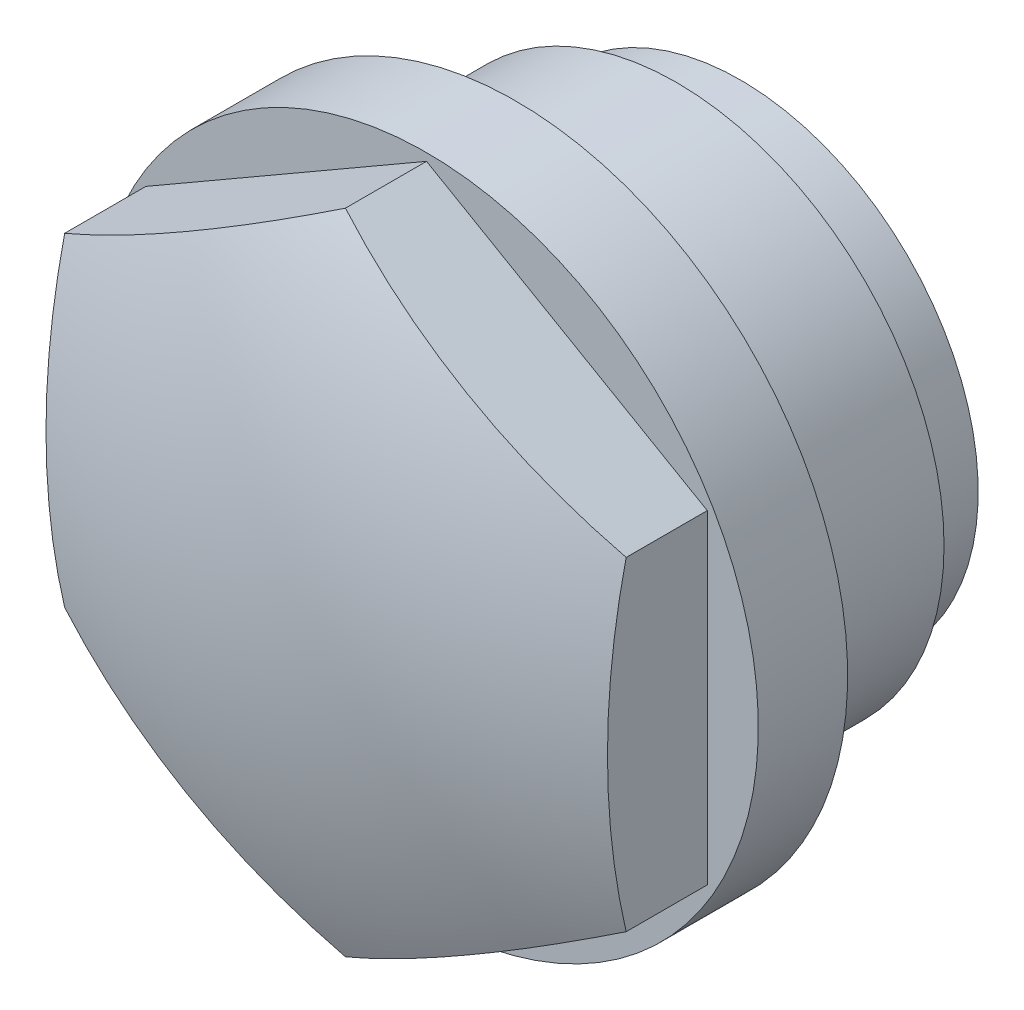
ISO-10303-21;
HEADER;
FILE_DESCRIPTION(('STEP AP214'),'2;1');
FILE_NAME('part.step','',(''),(''),'','','');
FILE_SCHEMA(('AUTOMOTIVE_DESIGN { 1 0 10303 214 1 1 1 1 }'));
ENDSEC;
DATA;
#1=APPLICATION_CONTEXT('core data for automotive mechanical design processes');
#2=APPLICATION_PROTOCOL_DEFINITION('international standard','automotive_design',2000,#1);
#3=PRODUCT_CONTEXT('',#1,'mechanical');
#4=PRODUCT('Part','Part','',(#3));
#5=PRODUCT_RELATED_PRODUCT_CATEGORY('part','',(#4));
#6=PRODUCT_DEFINITION_FORMATION('','',#4);
#7=PRODUCT_DEFINITION_CONTEXT('part definition',#1,'design');
#8=PRODUCT_DEFINITION('design','',#6,#7);
#9=PRODUCT_DEFINITION_SHAPE('','',#8);
#10=(LENGTH_UNIT() NAMED_UNIT(*) SI_UNIT(.MILLI.,.METRE.));
#11=(NAMED_UNIT(*) PLANE_ANGLE_UNIT() SI_UNIT($,.RADIAN.));
#12=(NAMED_UNIT(*) SI_UNIT($,.STERADIAN.) SOLID_ANGLE_UNIT());
#13=UNCERTAINTY_MEASURE_WITH_UNIT(LENGTH_MEASURE(1.E-05),#10,'distance_accuracy_value','');
#14=(GEOMETRIC_REPRESENTATION_CONTEXT(3) GLOBAL_UNCERTAINTY_ASSIGNED_CONTEXT((#13)) GLOBAL_UNIT_ASSIGNED_CONTEXT((#10,
#11,#12)) REPRESENTATION_CONTEXT('',''));
#15=CARTESIAN_POINT('',(0.,0.,0.));
#16=DIRECTION('',(0.,0.,1.));
#17=DIRECTION('',(1.,0.,0.));
#18=AXIS2_PLACEMENT_3D('',#15,#16,#17);
#19=CARTESIAN_POINT('',(0.,0.,-14.638539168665));
#20=DIRECTION('',(0.,0.,-1.));
#21=DIRECTION('',(-1.,0.,0.));
#22=AXIS2_PLACEMENT_3D('',#19,#20,#21);
#23=CYLINDRICAL_SURFACE('',#22,13.);
#24=CARTESIAN_POINT('',(0.,0.,0.));
#25=DIRECTION('',(0.,0.,-1.));
#26=DIRECTION('',(-1.,0.,0.));
#27=AXIS2_PLACEMENT_3D('',#24,#25,#26);
#28=CIRCLE('',#27,13.);
#29=CARTESIAN_POINT('',(-13.,0.,0.));
#30=VERTEX_POINT('',#29);
#31=EDGE_CURVE('E103',#30,#30,#28,.T.);
#32=ORIENTED_EDGE('',*,*,#31,.F.);
#33=EDGE_LOOP('',(#32));
#34=FACE_BOUND('',#33,.T.);
#35=CARTESIAN_POINT('',(0.,0.,3.5));
#36=DIRECTION('',(0.,0.,-1.));
#37=DIRECTION('',(-1.,0.,0.));
#38=AXIS2_PLACEMENT_3D('',#35,#36,#37);
#39=CIRCLE('',#38,13.);
#40=CARTESIAN_POINT('',(-13.,0.,3.5));
#41=VERTEX_POINT('',#40);
#42=EDGE_CURVE('E118',#41,#41,#39,.T.);
#43=ORIENTED_EDGE('',*,*,#42,.T.);
#44=EDGE_LOOP('',(#43));
#45=FACE_BOUND('',#44,.T.);
#46=ADVANCED_FACE('F14',(#34,#45),#23,.T.);
#47=CARTESIAN_POINT('',(0.,12.7017059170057,3.5));
#48=DIRECTION('',(0.,0.,-1.));
#49=DIRECTION('',(-1.,0.,0.));
#50=AXIS2_PLACEMENT_3D('',#47,#48,#49);
#51=PLANE('',#50);
#52=ORIENTED_EDGE('',*,*,#42,.F.);
#53=EDGE_LOOP('',(#52));
#54=FACE_BOUND('',#53,.T.);
#55=DIRECTION('',(0.,1.,0.));
#56=VECTOR('',#55,1.);
#57=CARTESIAN_POINT('',(-10.9999999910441,-6.35085295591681,3.5));
#58=LINE('',#57,#56);
#59=CARTESIAN_POINT('',(-10.9999999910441,-6.35085295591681,3.5));
#60=VERTEX_POINT('',#59);
#61=CARTESIAN_POINT('',(-10.9999999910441,6.3508529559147,3.5));
#62=VERTEX_POINT('',#61);
#63=EDGE_CURVE('E93',#60,#62,#58,.T.);
#64=ORIENTED_EDGE('',*,*,#63,.T.);
#65=DIRECTION('',(0.866025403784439,0.5,0.));
#66=VECTOR('',#65,1.);
#67=CARTESIAN_POINT('',(-10.9999999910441,6.3508529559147,3.5));
#68=LINE('',#67,#66);
#69=CARTESIAN_POINT('',(-7.35522753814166E-13,12.7017059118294,3.5));
#70=VERTEX_POINT('',#69);
#71=EDGE_CURVE('E83',#62,#70,#68,.T.);
#72=ORIENTED_EDGE('',*,*,#71,.T.);
#73=DIRECTION('',(0.866025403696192,-0.500000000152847,0.));
#74=VECTOR('',#73,1.);
#75=CARTESIAN_POINT('',(-7.35522753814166E-13,12.7017059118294,3.5));
#76=LINE('',#75,#74);
#77=CARTESIAN_POINT('',(10.99999999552,6.3508529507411,3.5));
#78=VERTEX_POINT('',#77);
#79=EDGE_CURVE('E68',#70,#78,#76,.T.);
#80=ORIENTED_EDGE('',*,*,#79,.T.);
#81=DIRECTION('',(0.,-1.,0.));
#82=VECTOR('',#81,1.);
#83=CARTESIAN_POINT('',(10.99999999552,6.3508529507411,3.5));
#84=LINE('',#83,#82);
#85=CARTESIAN_POINT('',(10.99999999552,-6.3508529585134,3.5));
#86=VERTEX_POINT('',#85);
#87=EDGE_CURVE('E80',#78,#86,#84,.T.);
#88=ORIENTED_EDGE('',*,*,#87,.T.);
#89=DIRECTION('',(-0.86602540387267,-0.499999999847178,0.));
#90=VECTOR('',#89,1.);
#91=CARTESIAN_POINT('',(10.99999999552,-6.35085295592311,3.5));
#92=LINE('',#91,#90);
#93=CARTESIAN_POINT('',(1.97758476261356E-12,-12.7017059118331,3.5));
#94=VERTEX_POINT('',#93);
#95=EDGE_CURVE('E28',#86,#94,#92,.T.);
#96=ORIENTED_EDGE('',*,*,#95,.T.);
#97=DIRECTION('',(-0.866025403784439,0.5,0.));
#98=VECTOR('',#97,1.);
#99=CARTESIAN_POINT('',(1.97758476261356E-12,-12.7017059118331,3.5));
#100=LINE('',#99,#98);
#101=EDGE_CURVE('E87',#94,#60,#100,.T.);
#102=ORIENTED_EDGE('',*,*,#101,.T.);
#103=EDGE_LOOP('',(#64,#72,#80,#88,#96,#102));
#104=FACE_BOUND('',#103,.T.);
#105=ADVANCED_FACE('F79',(#54,#104),#51,.F.);
#106=CARTESIAN_POINT('',(0.,0.,-8.8));
#107=DIRECTION('',(0.,0.,-1.));
#108=DIRECTION('',(-1.,0.,0.));
#109=AXIS2_PLACEMENT_3D('',#106,#107,#108);
#110=PLANE('',#109);
#111=CARTESIAN_POINT('',(0.,0.,-8.8));
#112=DIRECTION('',(0.,0.,-1.));
#113=DIRECTION('',(-1.,0.,0.));
#114=AXIS2_PLACEMENT_3D('',#111,#112,#113);
#115=CIRCLE('',#114,9.3155);
#116=CARTESIAN_POINT('',(-9.3155,0.,-8.8));
#117=VERTEX_POINT('',#116);
#118=EDGE_CURVE('E115',#117,#117,#115,.T.);
#119=ORIENTED_EDGE('',*,*,#118,.T.);
#120=EDGE_LOOP('',(#119));
#121=FACE_BOUND('',#120,.T.);
#122=ADVANCED_FACE('F160',(#121),#110,.T.);
#123=CARTESIAN_POINT('',(0.,0.,-14.638539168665));
#124=DIRECTION('',(0.,0.,-1.));
#125=DIRECTION('',(-1.,0.,0.));
#126=AXIS2_PLACEMENT_3D('',#123,#124,#125);
#127=CYLINDRICAL_SURFACE('',#126,9.3155);
#128=ORIENTED_EDGE('',*,*,#118,.F.);
#129=EDGE_LOOP('',(#128));
#130=FACE_BOUND('',#129,.T.);
#131=CARTESIAN_POINT('',(0.,0.,-6.3));
#132=DIRECTION('',(0.,0.,-1.));
#133=DIRECTION('',(-1.,0.,0.));
#134=AXIS2_PLACEMENT_3D('',#131,#132,#133);
#135=CIRCLE('',#134,9.3155);
#136=CARTESIAN_POINT('',(-9.3155,0.,-6.3));
#137=VERTEX_POINT('',#136);
#138=EDGE_CURVE('E112',#137,#137,#135,.T.);
#139=ORIENTED_EDGE('',*,*,#138,.T.);
#140=EDGE_LOOP('',(#139));
#141=FACE_BOUND('',#140,.T.);
#142=ADVANCED_FACE('F184',(#130,#141),#127,.T.);
#143=CARTESIAN_POINT('',(0.,9.3155,-6.3));
#144=DIRECTION('',(0.,0.,-1.));
#145=DIRECTION('',(-1.,0.,0.));
#146=AXIS2_PLACEMENT_3D('',#143,#144,#145);
#147=PLANE('',#146);
#148=CARTESIAN_POINT('',(0.,0.,-6.3));
#149=DIRECTION('',(0.,0.,-1.));
#150=DIRECTION('',(-1.,0.,0.));
#151=AXIS2_PLACEMENT_3D('',#148,#149,#150);
#152=CIRCLE('',#151,10.4775);
#153=CARTESIAN_POINT('',(-10.4775,0.,-6.3));
#154=VERTEX_POINT('',#153);
#155=EDGE_CURVE('E109',#154,#154,#152,.T.);
#156=ORIENTED_EDGE('',*,*,#155,.T.);
#157=EDGE_LOOP('',(#156));
#158=FACE_BOUND('',#157,.T.);
#159=ORIENTED_EDGE('',*,*,#138,.F.);
#160=EDGE_LOOP('',(#159));
#161=FACE_BOUND('',#160,.T.);
#162=ADVANCED_FACE('F177',(#158,#161),#147,.T.);
#163=CARTESIAN_POINT('',(0.,0.,-14.638539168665));
#164=DIRECTION('',(0.,0.,-1.));
#165=DIRECTION('',(-1.,0.,0.));
#166=AXIS2_PLACEMENT_3D('',#163,#164,#165);
#167=CYLINDRICAL_SURFACE('',#166,10.4775);
#168=ORIENTED_EDGE('',*,*,#155,.F.);
#169=EDGE_LOOP('',(#168));
#170=FACE_BOUND('',#169,.T.);
#171=CARTESIAN_POINT('',(0.,0.,0.));
#172=DIRECTION('',(0.,0.,-1.));
#173=DIRECTION('',(-1.,0.,0.));
#174=AXIS2_PLACEMENT_3D('',#171,#172,#173);
#175=CIRCLE('',#174,10.4775);
#176=CARTESIAN_POINT('',(-10.4775,0.,0.));
#177=VERTEX_POINT('',#176);
#178=EDGE_CURVE('E106',#177,#177,#175,.T.);
#179=ORIENTED_EDGE('',*,*,#178,.T.);
#180=EDGE_LOOP('',(#179));
#181=FACE_BOUND('',#180,.T.);
#182=ADVANCED_FACE('F168',(#170,#181),#167,.T.);
#183=CARTESIAN_POINT('',(0.,13.,0.));
#184=DIRECTION('',(0.,0.,1.));
#185=DIRECTION('',(1.,0.,0.));
#186=AXIS2_PLACEMENT_3D('',#183,#184,#185);
#187=PLANE('',#186);
#188=ORIENTED_EDGE('',*,*,#178,.F.);
#189=EDGE_LOOP('',(#188));
#190=FACE_BOUND('',#189,.T.);
#191=ORIENTED_EDGE('',*,*,#31,.T.);
#192=EDGE_LOOP('',(#191));
#193=FACE_BOUND('',#192,.T.);
#194=ADVANCED_FACE('F166',(#190,#193),#187,.F.);
#195=CARTESIAN_POINT('',(-10.9999999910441,6.3508529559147,9.50000000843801));
#196=DIRECTION('',(-0.5,0.866025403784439,0.));
#197=DIRECTION('',(0.866025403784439,0.5,0.));
#198=AXIS2_PLACEMENT_3D('',#195,#196,#197);
#199=PLANE('',#198);
#200=DIRECTION('',(0.,0.,-1.));
#201=VECTOR('',#200,1.);
#202=CARTESIAN_POINT('',(-7.35522753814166E-13,12.7017059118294,9.50000000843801));
#203=LINE('',#202,#201);
#204=CARTESIAN_POINT('',(-8.96633451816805E-09,12.7017059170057,6.67842281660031));
#205=VERTEX_POINT('',#204);
#206=EDGE_CURVE('E36',#205,#70,#203,.T.);
#207=ORIENTED_EDGE('',*,*,#206,.T.);
#208=ORIENTED_EDGE('',*,*,#71,.F.);
#209=DIRECTION('',(0.,0.,-1.));
#210=VECTOR('',#209,1.);
#211=CARTESIAN_POINT('',(-10.9999999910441,6.3508529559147,9.50000000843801));
#212=LINE('',#211,#210);
#213=CARTESIAN_POINT('',(-10.9999999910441,6.3508529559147,6.6784228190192));
#214=VERTEX_POINT('',#213);
#215=EDGE_CURVE('E101',#214,#62,#212,.T.);
#216=ORIENTED_EDGE('',*,*,#215,.F.);
#217=CARTESIAN_POINT('',(-5.49999999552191,9.52627943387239,-20.4999999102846));
#218=DIRECTION('',(-0.5,0.866025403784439,0.));
#219=DIRECTION('',(0.866025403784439,0.5,0.));
#220=AXIS2_PLACEMENT_3D('',#217,#218,#219);
#221=CIRCLE('',#220,27.9105713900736);
#222=EDGE_CURVE('E9',#205,#214,#221,.F.);
#223=ORIENTED_EDGE('',*,*,#222,.F.);
#224=EDGE_LOOP('',(#207,#208,#216,#223));
#225=FACE_BOUND('',#224,.T.);
#226=ADVANCED_FACE('F138',(#225),#199,.T.);
#227=CARTESIAN_POINT('',(-10.9999999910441,-6.35085295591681,9.50000000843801));
#228=DIRECTION('',(-1.,0.,0.));
#229=DIRECTION('',(0.,0.,1.));
#230=AXIS2_PLACEMENT_3D('',#227,#228,#229);
#231=PLANE('',#230);
#232=ORIENTED_EDGE('',*,*,#215,.T.);
#233=ORIENTED_EDGE('',*,*,#63,.F.);
#234=DIRECTION('',(0.,0.,-1.));
#235=VECTOR('',#234,1.);
#236=CARTESIAN_POINT('',(-10.9999999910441,-6.35085295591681,9.50000000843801));
#237=LINE('',#236,#235);
#238=CARTESIAN_POINT('',(-10.9999999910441,-6.35085295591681,6.6784228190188));
#239=VERTEX_POINT('',#238);
#240=EDGE_CURVE('E99',#239,#60,#237,.T.);
#241=ORIENTED_EDGE('',*,*,#240,.F.);
#242=CARTESIAN_POINT('',(-10.9999999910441,0.,-20.4999999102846));
#243=DIRECTION('',(-1.,0.,0.));
#244=DIRECTION('',(0.,0.,1.));
#245=AXIS2_PLACEMENT_3D('',#242,#243,#244);
#246=CIRCLE('',#245,27.9105713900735);
#247=EDGE_CURVE('E21',#214,#239,#246,.F.);
#248=ORIENTED_EDGE('',*,*,#247,.F.);
#249=EDGE_LOOP('',(#232,#233,#241,#248));
#250=FACE_BOUND('',#249,.T.);
#251=ADVANCED_FACE('F135',(#250),#231,.T.);
#252=CARTESIAN_POINT('',(1.97758476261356E-12,-12.7017059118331,9.50000000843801));
#253=DIRECTION('',(-0.5,-0.866025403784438,0.));
#254=DIRECTION('',(-0.866025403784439,0.5,0.));
#255=AXIS2_PLACEMENT_3D('',#252,#253,#254);
#256=PLANE('',#255);
#257=ORIENTED_EDGE('',*,*,#240,.T.);
#258=ORIENTED_EDGE('',*,*,#101,.F.);
#259=DIRECTION('',(0.,0.,-1.));
#260=VECTOR('',#259,1.);
#261=CARTESIAN_POINT('',(1.97758476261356E-12,-12.7017059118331,9.50000000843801));
#262=LINE('',#261,#260);
#263=CARTESIAN_POINT('',(1.98018684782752E-12,-12.7017059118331,6.6784228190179));
#264=VERTEX_POINT('',#263);
#265=EDGE_CURVE('E97',#264,#94,#262,.T.);
#266=ORIENTED_EDGE('',*,*,#265,.F.);
#267=CARTESIAN_POINT('',(-5.49999999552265,-9.526279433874,-20.4999999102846));
#268=DIRECTION('',(-0.5,-0.866025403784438,0.));
#269=DIRECTION('',(-0.866025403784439,0.5,0.));
#270=AXIS2_PLACEMENT_3D('',#267,#268,#269);
#271=CIRCLE('',#270,27.910571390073);
#272=EDGE_CURVE('E127',#239,#264,#271,.F.);
#273=ORIENTED_EDGE('',*,*,#272,.F.);
#274=EDGE_LOOP('',(#257,#258,#266,#273));
#275=FACE_BOUND('',#274,.T.);
#276=ADVANCED_FACE('F143',(#275),#256,.T.);
#277=CARTESIAN_POINT('',(10.99999999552,-6.35085295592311,9.50000000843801));
#278=DIRECTION('',(0.499999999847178,-0.86602540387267,0.));
#279=DIRECTION('',(-0.86602540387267,-0.499999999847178,0.));
#280=AXIS2_PLACEMENT_3D('',#277,#278,#279);
#281=PLANE('',#280);
#282=ORIENTED_EDGE('',*,*,#265,.T.);
#283=ORIENTED_EDGE('',*,*,#95,.F.);
#284=DIRECTION('',(0.,0.,-1.));
#285=VECTOR('',#284,1.);
#286=CARTESIAN_POINT('',(10.99999999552,-6.35085295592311,9.50000000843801));
#287=LINE('',#286,#285);
#288=CARTESIAN_POINT('',(10.99999999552,-6.35085295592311,6.67842281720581));
#289=VERTEX_POINT('',#288);
#290=EDGE_CURVE('E74',#289,#86,#287,.T.);
#291=ORIENTED_EDGE('',*,*,#290,.F.);
#292=CARTESIAN_POINT('',(5.49999999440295,-9.5262794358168,-20.4999999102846));
#293=DIRECTION('',(0.499999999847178,-0.86602540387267,0.));
#294=DIRECTION('',(-0.86602540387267,-0.499999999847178,0.));
#295=AXIS2_PLACEMENT_3D('',#292,#293,#294);
#296=CIRCLE('',#295,27.9105713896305);
#297=EDGE_CURVE('E124',#264,#289,#296,.F.);
#298=ORIENTED_EDGE('',*,*,#297,.F.);
#299=EDGE_LOOP('',(#282,#283,#291,#298));
#300=FACE_BOUND('',#299,.T.);
#301=ADVANCED_FACE('F139',(#300),#281,.T.);
#302=CARTESIAN_POINT('',(10.99999999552,6.3508529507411,9.50000000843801));
#303=DIRECTION('',(1.,0.,0.));
#304=DIRECTION('',(0.,0.,-1.));
#305=AXIS2_PLACEMENT_3D('',#302,#303,#304);
#306=PLANE('',#305);
#307=ORIENTED_EDGE('',*,*,#290,.T.);
#308=ORIENTED_EDGE('',*,*,#87,.F.);
#309=DIRECTION('',(0.,0.,-1.));
#310=VECTOR('',#309,1.);
#311=CARTESIAN_POINT('',(10.99999999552,6.3508529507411,9.50000000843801));
#312=LINE('',#311,#310);
#313=CARTESIAN_POINT('',(10.99999999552,6.3508529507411,6.6784228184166));
#314=VERTEX_POINT('',#313);
#315=EDGE_CURVE('E65',#314,#78,#312,.T.);
#316=ORIENTED_EDGE('',*,*,#315,.F.);
#317=CARTESIAN_POINT('',(10.99999999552,0.,-20.4999999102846));
#318=DIRECTION('',(1.,0.,0.));
#319=DIRECTION('',(0.,0.,-1.));
#320=AXIS2_PLACEMENT_3D('',#317,#318,#319);
#321=CIRCLE('',#320,27.9105713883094);
#322=EDGE_CURVE('E122',#289,#314,#321,.F.);
#323=ORIENTED_EDGE('',*,*,#322,.F.);
#324=EDGE_LOOP('',(#307,#308,#316,#323));
#325=FACE_BOUND('',#324,.T.);
#326=ADVANCED_FACE('F85',(#325),#306,.T.);
#327=CARTESIAN_POINT('',(-7.35522753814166E-13,12.7017059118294,9.50000000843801));
#328=DIRECTION('',(0.500000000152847,0.866025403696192,0.));
#329=DIRECTION('',(0.866025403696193,-0.500000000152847,0.));
#330=AXIS2_PLACEMENT_3D('',#327,#328,#329);
#331=PLANE('',#330);
#332=ORIENTED_EDGE('',*,*,#315,.T.);
#333=ORIENTED_EDGE('',*,*,#79,.F.);
#334=ORIENTED_EDGE('',*,*,#206,.F.);
#335=CARTESIAN_POINT('',(5.49999999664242,9.5262794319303,-20.4999999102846));
#336=DIRECTION('',(0.500000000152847,0.866025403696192,0.));
#337=DIRECTION('',(0.866025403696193,-0.500000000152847,0.));
#338=AXIS2_PLACEMENT_3D('',#335,#336,#337);
#339=CIRCLE('',#338,27.9105713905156);
#340=EDGE_CURVE('E70',#314,#205,#339,.F.);
#341=ORIENTED_EDGE('',*,*,#340,.F.);
#342=EDGE_LOOP('',(#332,#333,#334,#341));
#343=FACE_BOUND('',#342,.T.);
#344=ADVANCED_FACE('F67',(#343),#331,.T.);
#345=CARTESIAN_POINT('',(0.,0.,-20.4999999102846));
#346=DIRECTION('',(1.,0.,0.));
#347=DIRECTION('',(0.,0.,-1.));
#348=AXIS2_PLACEMENT_3D('',#345,#346,#347);
#349=SPHERICAL_SURFACE('',#348,29.9999999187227);
#350=ORIENTED_EDGE('',*,*,#340,.T.);
#351=ORIENTED_EDGE('',*,*,#222,.T.);
#352=ORIENTED_EDGE('',*,*,#247,.T.);
#353=ORIENTED_EDGE('',*,*,#272,.T.);
#354=ORIENTED_EDGE('',*,*,#297,.T.);
#355=ORIENTED_EDGE('',*,*,#322,.T.);
#356=EDGE_LOOP('',(#350,#351,#352,#353,#354,#355));
#357=FACE_BOUND('',#356,.T.);
#358=ADVANCED_FACE('F131',(#357),#349,.T.);
#359=CLOSED_SHELL('',(#46,#105,#122,#142,#162,#182,#194,#226,#251,#276,#301,#326,#344,#358));
#360=MANIFOLD_SOLID_BREP('B1',#359);
#361=ADVANCED_BREP_SHAPE_REPRESENTATION('',(#18,#360),#14);
#362=SHAPE_DEFINITION_REPRESENTATION(#9,#361);
ENDSEC;
END-ISO-10303-21;
